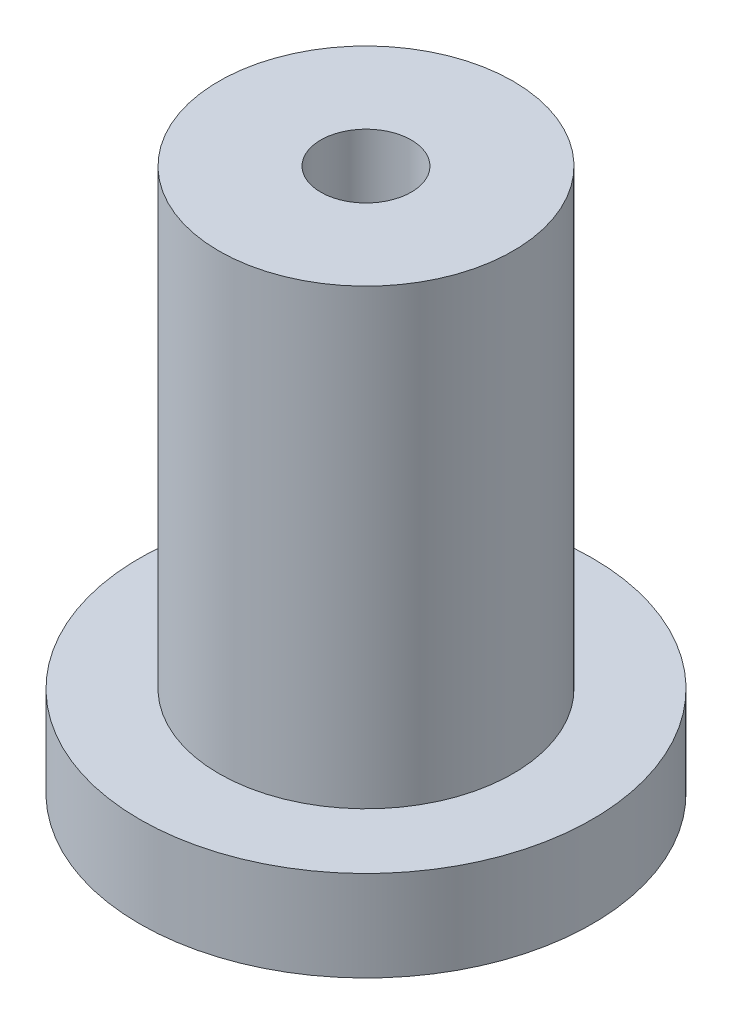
ISO-10303-21;
HEADER;
FILE_DESCRIPTION(('STEP AP214'),'2;1');
FILE_NAME('part.step','',(''),(''),'','','');
FILE_SCHEMA(('AUTOMOTIVE_DESIGN { 1 0 10303 214 1 1 1 1 }'));
ENDSEC;
DATA;
#1=APPLICATION_CONTEXT('core data for automotive mechanical design processes');
#2=APPLICATION_PROTOCOL_DEFINITION('international standard','automotive_design',2000,#1);
#3=PRODUCT_CONTEXT('',#1,'mechanical');
#4=PRODUCT('Part','Part','',(#3));
#5=PRODUCT_RELATED_PRODUCT_CATEGORY('part','',(#4));
#6=PRODUCT_DEFINITION_FORMATION('','',#4);
#7=PRODUCT_DEFINITION_CONTEXT('part definition',#1,'design');
#8=PRODUCT_DEFINITION('design','',#6,#7);
#9=PRODUCT_DEFINITION_SHAPE('','',#8);
#10=(LENGTH_UNIT() NAMED_UNIT(*) SI_UNIT(.MILLI.,.METRE.));
#11=(NAMED_UNIT(*) PLANE_ANGLE_UNIT() SI_UNIT($,.RADIAN.));
#12=(NAMED_UNIT(*) SI_UNIT($,.STERADIAN.) SOLID_ANGLE_UNIT());
#13=UNCERTAINTY_MEASURE_WITH_UNIT(LENGTH_MEASURE(1.E-05),#10,'distance_accuracy_value','');
#14=(GEOMETRIC_REPRESENTATION_CONTEXT(3) GLOBAL_UNCERTAINTY_ASSIGNED_CONTEXT((#13)) GLOBAL_UNIT_ASSIGNED_CONTEXT((#10,
#11,#12)) REPRESENTATION_CONTEXT('',''));
#15=CARTESIAN_POINT('',(0.,0.,0.));
#16=DIRECTION('',(0.,0.,1.));
#17=DIRECTION('',(1.,0.,0.));
#18=AXIS2_PLACEMENT_3D('',#15,#16,#17);
#19=CARTESIAN_POINT('',(0.,2.,0.));
#20=DIRECTION('',(0.,-1.,0.));
#21=DIRECTION('',(0.,0.,-1.));
#22=AXIS2_PLACEMENT_3D('',#19,#20,#21);
#23=CYLINDRICAL_SURFACE('',#22,5.);
#24=CARTESIAN_POINT('',(0.,2.,0.));
#25=DIRECTION('',(0.,1.,0.));
#26=DIRECTION('',(0.,0.,1.));
#27=AXIS2_PLACEMENT_3D('',#24,#25,#26);
#28=CIRCLE('',#27,5.);
#29=CARTESIAN_POINT('',(0.,2.,5.));
#30=VERTEX_POINT('',#29);
#31=EDGE_CURVE('E42',#30,#30,#28,.T.);
#32=ORIENTED_EDGE('',*,*,#31,.F.);
#33=EDGE_LOOP('',(#32));
#34=FACE_BOUND('',#33,.T.);
#35=CARTESIAN_POINT('',(0.,0.,0.));
#36=DIRECTION('',(0.,1.,0.));
#37=DIRECTION('',(0.,0.,1.));
#38=AXIS2_PLACEMENT_3D('',#35,#36,#37);
#39=CIRCLE('',#38,5.);
#40=CARTESIAN_POINT('',(0.,0.,5.));
#41=VERTEX_POINT('',#40);
#42=EDGE_CURVE('E38',#41,#41,#39,.T.);
#43=ORIENTED_EDGE('',*,*,#42,.T.);
#44=EDGE_LOOP('',(#43));
#45=FACE_BOUND('',#44,.T.);
#46=ADVANCED_FACE('F35',(#34,#45),#23,.T.);
#47=CARTESIAN_POINT('',(0.,2.,0.));
#48=DIRECTION('',(0.,1.,0.));
#49=DIRECTION('',(0.,0.,1.));
#50=AXIS2_PLACEMENT_3D('',#47,#48,#49);
#51=PLANE('',#50);
#52=CARTESIAN_POINT('',(0.,2.,0.));
#53=DIRECTION('',(0.,1.,0.));
#54=DIRECTION('',(0.,0.,1.));
#55=AXIS2_PLACEMENT_3D('',#52,#53,#54);
#56=CIRCLE('',#55,3.25);
#57=CARTESIAN_POINT('',(0.,2.,3.25));
#58=VERTEX_POINT('',#57);
#59=EDGE_CURVE('E10',#58,#58,#56,.T.);
#60=ORIENTED_EDGE('',*,*,#59,.F.);
#61=EDGE_LOOP('',(#60));
#62=FACE_BOUND('',#61,.T.);
#63=ORIENTED_EDGE('',*,*,#31,.T.);
#64=EDGE_LOOP('',(#63));
#65=FACE_BOUND('',#64,.T.);
#66=ADVANCED_FACE('F79',(#62,#65),#51,.T.);
#67=CARTESIAN_POINT('',(0.,0.,0.));
#68=DIRECTION('',(0.,1.,0.));
#69=DIRECTION('',(0.,0.,1.));
#70=AXIS2_PLACEMENT_3D('',#67,#68,#69);
#71=PLANE('',#70);
#72=ORIENTED_EDGE('',*,*,#42,.F.);
#73=EDGE_LOOP('',(#72));
#74=FACE_BOUND('',#73,.T.);
#75=ADVANCED_FACE('F74',(#74),#71,.F.);
#76=CARTESIAN_POINT('',(0.,12.,0.));
#77=DIRECTION('',(0.,-1.,0.));
#78=DIRECTION('',(0.,0.,-1.));
#79=AXIS2_PLACEMENT_3D('',#76,#77,#78);
#80=CYLINDRICAL_SURFACE('',#79,3.25);
#81=CARTESIAN_POINT('',(0.,12.,0.));
#82=DIRECTION('',(0.,1.,0.));
#83=DIRECTION('',(0.,0.,1.));
#84=AXIS2_PLACEMENT_3D('',#81,#82,#83);
#85=CIRCLE('',#84,3.25);
#86=CARTESIAN_POINT('',(0.,12.,3.25));
#87=VERTEX_POINT('',#86);
#88=EDGE_CURVE('E48',#87,#87,#85,.T.);
#89=ORIENTED_EDGE('',*,*,#88,.F.);
#90=EDGE_LOOP('',(#89));
#91=FACE_BOUND('',#90,.T.);
#92=ORIENTED_EDGE('',*,*,#59,.T.);
#93=EDGE_LOOP('',(#92));
#94=FACE_BOUND('',#93,.T.);
#95=ADVANCED_FACE('F69',(#91,#94),#80,.T.);
#96=CARTESIAN_POINT('',(0.,12.,0.));
#97=DIRECTION('',(0.,1.,0.));
#98=DIRECTION('',(0.,0.,1.));
#99=AXIS2_PLACEMENT_3D('',#96,#97,#98);
#100=PLANE('',#99);
#101=CARTESIAN_POINT('',(0.,12.,0.));
#102=DIRECTION('',(0.,1.,0.));
#103=DIRECTION('',(0.,0.,1.));
#104=AXIS2_PLACEMENT_3D('',#101,#102,#103);
#105=CIRCLE('',#104,1.);
#106=CARTESIAN_POINT('',(0.,12.,1.));
#107=VERTEX_POINT('',#106);
#108=EDGE_CURVE('E52',#107,#107,#105,.T.);
#109=ORIENTED_EDGE('',*,*,#108,.F.);
#110=EDGE_LOOP('',(#109));
#111=FACE_BOUND('',#110,.T.);
#112=ORIENTED_EDGE('',*,*,#88,.T.);
#113=EDGE_LOOP('',(#112));
#114=FACE_BOUND('',#113,.T.);
#115=ADVANCED_FACE('F63',(#111,#114),#100,.T.);
#116=CARTESIAN_POINT('',(0.,9.,0.));
#117=DIRECTION('',(0.,1.,0.));
#118=DIRECTION('',(0.,0.,1.));
#119=AXIS2_PLACEMENT_3D('',#116,#117,#118);
#120=CYLINDRICAL_SURFACE('',#119,1.);
#121=CARTESIAN_POINT('',(0.,9.,0.));
#122=DIRECTION('',(0.,1.,0.));
#123=DIRECTION('',(0.,0.,1.));
#124=AXIS2_PLACEMENT_3D('',#121,#122,#123);
#125=CIRCLE('',#124,1.);
#126=CARTESIAN_POINT('',(0.,9.,1.));
#127=VERTEX_POINT('',#126);
#128=EDGE_CURVE('E51',#127,#127,#125,.T.);
#129=ORIENTED_EDGE('',*,*,#128,.F.);
#130=EDGE_LOOP('',(#129));
#131=FACE_BOUND('',#130,.T.);
#132=ORIENTED_EDGE('',*,*,#108,.T.);
#133=EDGE_LOOP('',(#132));
#134=FACE_BOUND('',#133,.T.);
#135=ADVANCED_FACE('F60',(#131,#134),#120,.F.);
#136=CARTESIAN_POINT('',(0.,9.,0.));
#137=DIRECTION('',(0.,1.,0.));
#138=DIRECTION('',(0.,0.,1.));
#139=AXIS2_PLACEMENT_3D('',#136,#137,#138);
#140=PLANE('',#139);
#141=ORIENTED_EDGE('',*,*,#128,.T.);
#142=EDGE_LOOP('',(#141));
#143=FACE_BOUND('',#142,.T.);
#144=ADVANCED_FACE('F58',(#143),#140,.T.);
#145=CLOSED_SHELL('',(#46,#66,#75,#95,#115,#135,#144));
#146=MANIFOLD_SOLID_BREP('B2',#145);
#147=ADVANCED_BREP_SHAPE_REPRESENTATION('',(#18,#146),#14);
#148=SHAPE_DEFINITION_REPRESENTATION(#9,#147);
ENDSEC;
END-ISO-10303-21;
